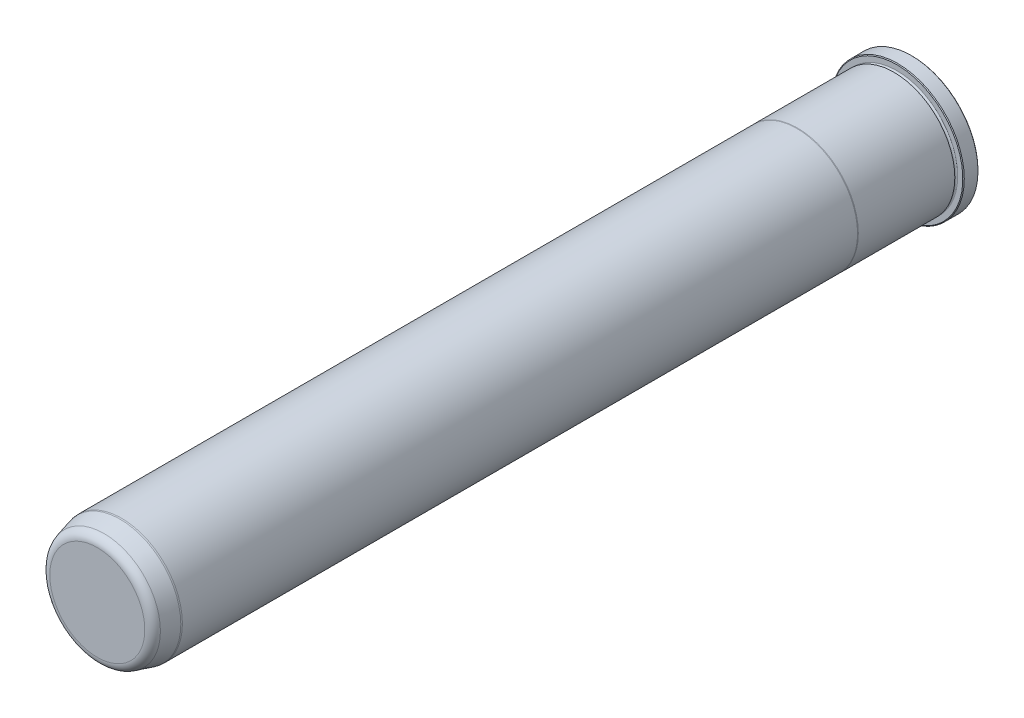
from build123d import *

# Parameters (mm, degrees)
FILLET6_R     = 4.7625
CHAMFER1_SIZE = 0.381


with BuildPart() as part:
    # Sketch1 → Revolve1 (revolve)
    with BuildSketch(Plane(origin=(0, 0, 0), x_dir=(0, 0, -1), z_dir=(1, 0, 0)), mode=Mode.PRIVATE) as revolve1_sk:
        with BuildLine():
            Line((0, 0), (0, 34.798))
            Line((0, 34.798), (-7.9248, 34.798))
            Line((-7.9248, 34.798), (-7.9248, 31.7373))
            ThreePointArc((-7.9248, 31.7373), (-8.6868, 30.9753), (-9.4488, 31.7373))
            Line((-9.4488, 31.7373), (-9.4488, 31.7627))
            Line((-9.4488, 31.7627), (-59.834763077, 31.7627))
            Line((-59.834763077, 31.7627), (-60.198, 31.7373))
            Line((-60.198, 31.7373), (-412.75, 31.7373))
            Line((-412.75, 31.7373), (-413.512, 31.670633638))
            Line((-413.512, 31.670633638), (-425.45, 28.471856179))
            Line((-425.45, 28.471856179), (-425.45, 0))
            Line((-425.45, 0), (0, 0))
        make_face()
    revolve(revolve1_sk.sketch.rotate(Axis((0, 0, 0), (0, 0, -1)), 90), axis=Axis((0, 0, 0), (0, 0, -1)))

    # Fillet6
    fillet6_edges = [part.edges().sort_by_distance(p)[0] for p in [
        (-28.471856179, 0, 425.45),
    ]]
    fillet(fillet6_edges, radius=FILLET6_R)

    # Chamfer1
    chamfer1_edges = [part.edges().sort_by_distance(p)[0] for p in [
        (-34.798, 0, 7.9248),
        (-34.798, 0, 0),
    ]]
    chamfer(chamfer1_edges, length=CHAMFER1_SIZE)


solid = part.part
